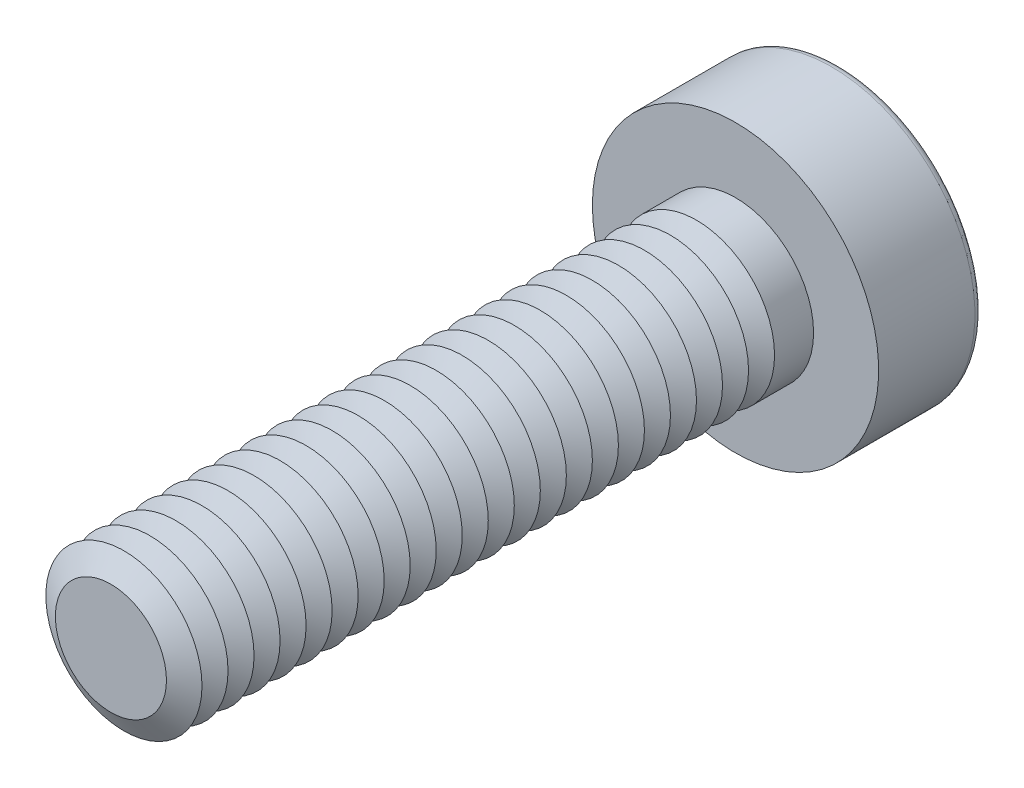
from build123d import *

# Parameters (mm, degrees)
SKETCH1_R           = 1.5
BOSS_EXTRUDE1_DEPTH = 12
SKETCH2_R           = 2.75
BOSS_EXTRUDE2_DEPTH = 2
CUT_EXTRUDE1_DEPTH  = 1.5
FILLET1_R           = 0.15
LPATTERN1_COUNT     = 23
LPATTERN1_PITCH     = 0.5


with BuildPart() as part:
    # Sketch1 → Boss-Extrude1 (new body)
    with BuildSketch(Plane.XY):
        Circle(SKETCH1_R)
    extrude(amount=BOSS_EXTRUDE1_DEPTH)

    # Sketch2 → Boss-Extrude2 (add)
    with BuildSketch(Plane(origin=(0, 0, 0), x_dir=(-1, 0, 0), z_dir=(0, 0, -1))):
        Circle(SKETCH2_R)
    extrude(amount=BOSS_EXTRUDE2_DEPTH)

    # Sketch3 → Cut-Extrude1 (cut)
    with BuildSketch(Plane(origin=(0, 0, -2), x_dir=(-1, 0, 0), z_dir=(0, 0, -1))):
        Polygon((-0.577350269, 1), (-1.154700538, 0), (-0.577350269, -1), (0.577350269, -1), (1.154700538, 0), (0.577350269, 1), align=None)
    extrude(amount=-CUT_EXTRUDE1_DEPTH, mode=Mode.SUBTRACT)

    # Fillet1
    fillet1_edges = [part.edges().sort_by_distance(p)[0] for p in [
        (2.75, 0, -2),
    ]]
    fillet(fillet1_edges, radius=FILLET1_R)

    # Cut-Extrude2 cone 1 section (on through the dimple's axis) → Cut-Extrude2 (revolve, cut)
    with BuildSketch(Plane(origin=(0, 0, -0.5), x_dir=(0, 1, 0), z_dir=(1, 0, 0))):
        Polygon((0, 0), (1, 0), (0, 0.577350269), align=None)
    revolve(axis=Axis((0, 0, -0.5), (0, 0, 1)), mode=Mode.SUBTRACT)

    # Cut-Extrude3 cone 1 section (on through the dimple's axis) → Cut-Extrude3 (revolve, cut)
    with BuildSketch(Plane(origin=(0, 0, -2), x_dir=(0, 1, 0), z_dir=(1, 0, 0))):
        Polygon((0, 0), (1.154700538, 0), (0, 0.309401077), align=None)
    revolve(axis=Axis((0, 0, -2), (0, 0, 1)), mode=Mode.SUBTRACT)

    # Sketch7 → Cut-Revolve1 (revolve, cut)
    with BuildSketch(Plane(origin=(0, 0, 0), x_dir=(0, 0, -1), z_dir=(1, 0, 0)), mode=Mode.PRIVATE) as cut_revolve1_sk:
        Polygon((-12, 1.066987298), (-11.75, 1.5), (-12.25, 1.5), align=None)
    cut_revolve1 = revolve(cut_revolve1_sk.sketch.rotate(Axis((0, 0, 12), (0, 0, -1)), 90), axis=Axis((0, 0, 12), (0, 0, -1)), mode=Mode.SUBTRACT)

    # LPattern1: Cut-Revolve1 ×23
    with Locations(*[(0, 0, -i * LPATTERN1_PITCH) for i in range(1, LPATTERN1_COUNT)]):
        add(cut_revolve1, mode=Mode.SUBTRACT)


solid = part.part
